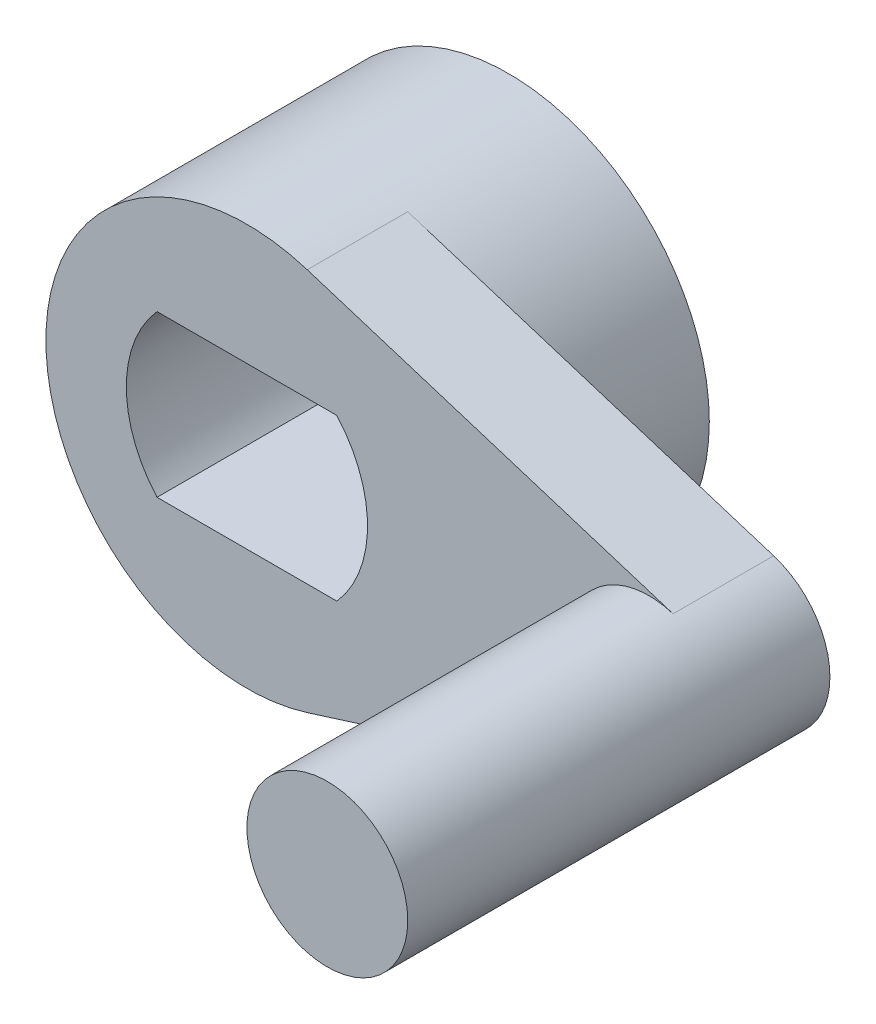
from build123d import *
from build123d.topology import SkipClean

# Parameters (mm, degrees)
ESQUISSE1_R             = 5
EXTRUSION1_DEPTH        = 6.5
EXTRUSION2_START        = -2.5
EXTRUSION2_DEPTH        = 2.5
ESQUISSE3_R             = 2
EXTRUSION3_DEPTH        = 8
ENL_V_MAT_EXTRU_1_DEPTH = 16.264337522


with BuildPart() as part:
    # Esquisse1 → Extrusion1 (new body)
    with BuildSketch(Plane.XY):
        with Locations(Location((0, 0, 0), (0, 0, 180))):
            Circle(ESQUISSE1_R)
    extrude(amount=EXTRUSION1_DEPTH)

    # Esquisse2 → Extrusion2 (add)
    with BuildSketch(Plane.XY.offset(6.5).offset(EXTRUSION2_START)):
        with BuildLine():
            Line((1.5, 4.769696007), (10.6, 1.907878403))
            ThreePointArc((10.6, 1.907878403), (12, 0), (10.6, -1.907878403))
            Line((10.6, -1.907878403), (1.5, -4.769696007))
            ThreePointArc((1.5, -4.769696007), (-5, 0), (1.5, 4.769696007))
        make_face()
    extrude(amount=EXTRUSION2_DEPTH)

    # Esquisse3 → Extrusion3 (add)
    with SkipClean():  # the faces are left unmerged after this step: merging them gives an invalid solid
        with BuildSketch(Plane.XY.offset(6.5)):
            with Locations((10, 0)):
                Circle(ESQUISSE3_R)
        extrude(amount=EXTRUSION3_DEPTH)

    # Esquisse4 → Enl_v. mat.-Extru.1 (cut, through all)
    with SkipClean():  # the faces are left unmerged after this step: merging them gives an invalid solid
        with BuildSketch(Plane.XY.offset(6.5)):
            with BuildLine():
                Line((-2.236067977, 2), (2.236067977, 2))
                ThreePointArc((2.236067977, 2), (3, 0), (2.236067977, -2))
                Line((2.236067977, -2), (-2.236067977, -2))
                ThreePointArc((-2.236067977, -2), (-3, 0), (-2.236067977, 2))
            make_face()
        extrude(amount=-ENL_V_MAT_EXTRU_1_DEPTH, mode=Mode.SUBTRACT)


solid = part.part
